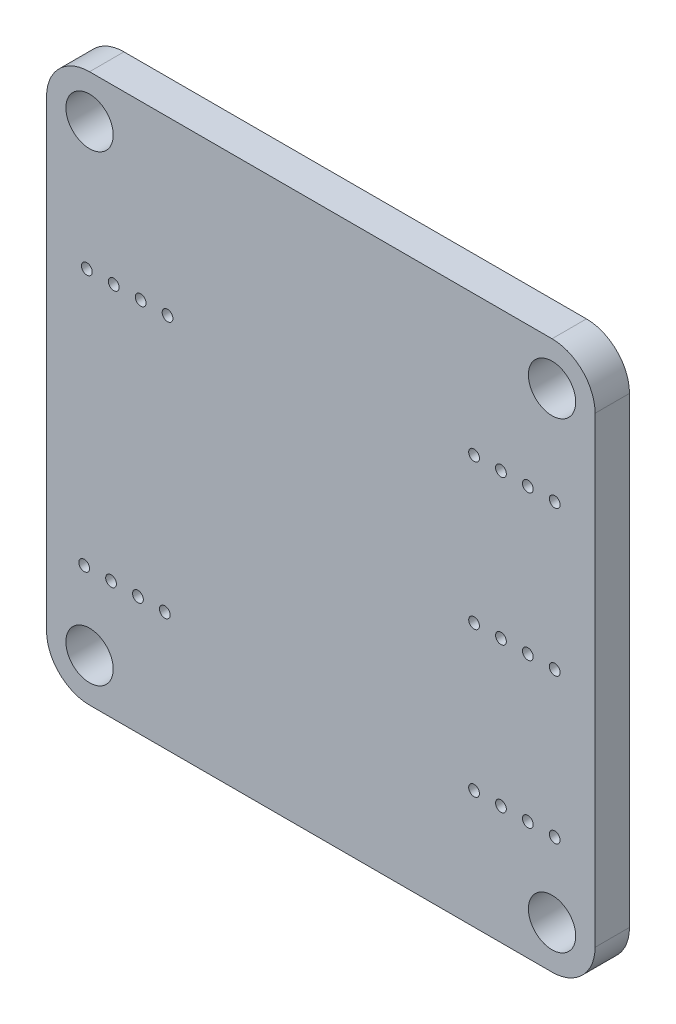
ISO-10303-21;
HEADER;
FILE_DESCRIPTION(('STEP AP214'),'2;1');
FILE_NAME('part.step','',(''),(''),'','','');
FILE_SCHEMA(('AUTOMOTIVE_DESIGN { 1 0 10303 214 1 1 1 1 }'));
ENDSEC;
DATA;
#1=APPLICATION_CONTEXT('core data for automotive mechanical design processes');
#2=APPLICATION_PROTOCOL_DEFINITION('international standard','automotive_design',2000,#1);
#3=PRODUCT_CONTEXT('',#1,'mechanical');
#4=PRODUCT('Part','Part','',(#3));
#5=PRODUCT_RELATED_PRODUCT_CATEGORY('part','',(#4));
#6=PRODUCT_DEFINITION_FORMATION('','',#4);
#7=PRODUCT_DEFINITION_CONTEXT('part definition',#1,'design');
#8=PRODUCT_DEFINITION('design','',#6,#7);
#9=PRODUCT_DEFINITION_SHAPE('','',#8);
#10=(LENGTH_UNIT() NAMED_UNIT(*) SI_UNIT(.MILLI.,.METRE.));
#11=(NAMED_UNIT(*) PLANE_ANGLE_UNIT() SI_UNIT($,.RADIAN.));
#12=(NAMED_UNIT(*) SI_UNIT($,.STERADIAN.) SOLID_ANGLE_UNIT());
#13=UNCERTAINTY_MEASURE_WITH_UNIT(LENGTH_MEASURE(1.E-05),#10,'distance_accuracy_value','');
#14=(GEOMETRIC_REPRESENTATION_CONTEXT(3) GLOBAL_UNCERTAINTY_ASSIGNED_CONTEXT((#13)) GLOBAL_UNIT_ASSIGNED_CONTEXT((#10,
#11,#12)) REPRESENTATION_CONTEXT('',''));
#15=CARTESIAN_POINT('',(0.,0.,0.));
#16=DIRECTION('',(0.,0.,1.));
#17=DIRECTION('',(1.,0.,0.));
#18=AXIS2_PLACEMENT_3D('',#15,#16,#17);
#19=CARTESIAN_POINT('',(214.,-97.5,-0.8));
#20=DIRECTION('',(0.,0.,1.));
#21=DIRECTION('',(1.,0.,0.));
#22=AXIS2_PLACEMENT_3D('',#19,#20,#21);
#23=CYLINDRICAL_SURFACE('',#22,1.1);
#24=CARTESIAN_POINT('',(214.,-97.5,0.));
#25=DIRECTION('',(0.,0.,1.));
#26=DIRECTION('',(1.,0.,0.));
#27=AXIS2_PLACEMENT_3D('',#24,#25,#26);
#28=CIRCLE('',#27,1.1);
#29=CARTESIAN_POINT('',(212.9,-97.5,0.));
#30=VERTEX_POINT('',#29);
#31=EDGE_CURVE('E471',#30,#30,#28,.T.);
#32=ORIENTED_EDGE('',*,*,#31,.F.);
#33=DIRECTION('',(0.,0.,1.));
#34=VECTOR('',#33,1.);
#35=CARTESIAN_POINT('',(212.9,-97.5,-0.8));
#36=LINE('',#35,#34);
#37=CARTESIAN_POINT('',(212.9,-97.5,1.6));
#38=VERTEX_POINT('',#37);
#39=EDGE_CURVE('E10',#30,#38,#36,.T.);
#40=ORIENTED_EDGE('',*,*,#39,.T.);
#41=CARTESIAN_POINT('',(214.,-97.5,1.6));
#42=DIRECTION('',(0.,0.,1.));
#43=DIRECTION('',(1.,0.,0.));
#44=AXIS2_PLACEMENT_3D('',#41,#42,#43);
#45=CIRCLE('',#44,1.1);
#46=EDGE_CURVE('E501',#38,#38,#45,.T.);
#47=ORIENTED_EDGE('',*,*,#46,.T.);
#48=ORIENTED_EDGE('',*,*,#39,.F.);
#49=EDGE_LOOP('',(#32,#40,#47,#48));
#50=FACE_BOUND('',#49,.T.);
#51=ADVANCED_FACE('F16',(#50),#23,.F.);
#52=CARTESIAN_POINT('',(214.125,-102.,-0.8));
#53=DIRECTION('',(0.,0.,1.));
#54=DIRECTION('',(1.,0.,0.));
#55=AXIS2_PLACEMENT_3D('',#52,#53,#54);
#56=CYLINDRICAL_SURFACE('',#55,0.25);
#57=CARTESIAN_POINT('',(214.125,-102.,0.));
#58=DIRECTION('',(0.,0.,1.));
#59=DIRECTION('',(1.,0.,0.));
#60=AXIS2_PLACEMENT_3D('',#57,#58,#59);
#61=CIRCLE('',#60,0.25);
#62=CARTESIAN_POINT('',(213.875,-102.,0.));
#63=VERTEX_POINT('',#62);
#64=EDGE_CURVE('E467',#63,#63,#61,.T.);
#65=ORIENTED_EDGE('',*,*,#64,.F.);
#66=DIRECTION('',(0.,0.,1.));
#67=VECTOR('',#66,1.);
#68=CARTESIAN_POINT('',(213.875,-102.,-0.8));
#69=LINE('',#68,#67);
#70=CARTESIAN_POINT('',(213.875,-102.,1.6));
#71=VERTEX_POINT('',#70);
#72=EDGE_CURVE('E20',#63,#71,#69,.T.);
#73=ORIENTED_EDGE('',*,*,#72,.T.);
#74=CARTESIAN_POINT('',(214.125,-102.,1.6));
#75=DIRECTION('',(0.,0.,1.));
#76=DIRECTION('',(1.,0.,0.));
#77=AXIS2_PLACEMENT_3D('',#74,#75,#76);
#78=CIRCLE('',#77,0.25);
#79=EDGE_CURVE('E466',#71,#71,#78,.T.);
#80=ORIENTED_EDGE('',*,*,#79,.T.);
#81=ORIENTED_EDGE('',*,*,#72,.F.);
#82=EDGE_LOOP('',(#65,#73,#80,#81));
#83=FACE_BOUND('',#82,.T.);
#84=ADVANCED_FACE('F18',(#83),#56,.F.);
#85=CARTESIAN_POINT('',(214.125,-108.75,-0.8));
#86=DIRECTION('',(0.,0.,1.));
#87=DIRECTION('',(1.,0.,0.));
#88=AXIS2_PLACEMENT_3D('',#85,#86,#87);
#89=CYLINDRICAL_SURFACE('',#88,0.25);
#90=CARTESIAN_POINT('',(214.125,-108.75,0.));
#91=DIRECTION('',(0.,0.,1.));
#92=DIRECTION('',(1.,0.,0.));
#93=AXIS2_PLACEMENT_3D('',#90,#91,#92);
#94=CIRCLE('',#93,0.25);
#95=CARTESIAN_POINT('',(213.875,-108.75,0.));
#96=VERTEX_POINT('',#95);
#97=EDGE_CURVE('E460',#96,#96,#94,.T.);
#98=ORIENTED_EDGE('',*,*,#97,.F.);
#99=DIRECTION('',(0.,0.,1.));
#100=VECTOR('',#99,1.);
#101=CARTESIAN_POINT('',(213.875,-108.75,-0.8));
#102=LINE('',#101,#100);
#103=CARTESIAN_POINT('',(213.875,-108.75,1.6));
#104=VERTEX_POINT('',#103);
#105=EDGE_CURVE('E583',#96,#104,#102,.T.);
#106=ORIENTED_EDGE('',*,*,#105,.T.);
#107=CARTESIAN_POINT('',(214.125,-108.75,1.6));
#108=DIRECTION('',(0.,0.,1.));
#109=DIRECTION('',(1.,0.,0.));
#110=AXIS2_PLACEMENT_3D('',#107,#108,#109);
#111=CIRCLE('',#110,0.25);
#112=EDGE_CURVE('E465',#104,#104,#111,.T.);
#113=ORIENTED_EDGE('',*,*,#112,.T.);
#114=ORIENTED_EDGE('',*,*,#105,.F.);
#115=EDGE_LOOP('',(#98,#106,#113,#114));
#116=FACE_BOUND('',#115,.T.);
#117=ADVANCED_FACE('F1039',(#116),#89,.F.);
#118=CARTESIAN_POINT('',(210.375,-108.75,-0.8));
#119=DIRECTION('',(0.,0.,1.));
#120=DIRECTION('',(1.,0.,0.));
#121=AXIS2_PLACEMENT_3D('',#118,#119,#120);
#122=CYLINDRICAL_SURFACE('',#121,0.25);
#123=CARTESIAN_POINT('',(210.375,-108.75,0.));
#124=DIRECTION('',(0.,0.,1.));
#125=DIRECTION('',(1.,0.,0.));
#126=AXIS2_PLACEMENT_3D('',#123,#124,#125);
#127=CIRCLE('',#126,0.25);
#128=CARTESIAN_POINT('',(210.125,-108.75,0.));
#129=VERTEX_POINT('',#128);
#130=EDGE_CURVE('E446',#129,#129,#127,.T.);
#131=ORIENTED_EDGE('',*,*,#130,.F.);
#132=DIRECTION('',(0.,0.,1.));
#133=VECTOR('',#132,1.);
#134=CARTESIAN_POINT('',(210.125,-108.75,-0.8));
#135=LINE('',#134,#133);
#136=CARTESIAN_POINT('',(210.125,-108.75,1.6));
#137=VERTEX_POINT('',#136);
#138=EDGE_CURVE('E581',#129,#137,#135,.T.);
#139=ORIENTED_EDGE('',*,*,#138,.T.);
#140=CARTESIAN_POINT('',(210.375,-108.75,1.6));
#141=DIRECTION('',(0.,0.,1.));
#142=DIRECTION('',(1.,0.,0.));
#143=AXIS2_PLACEMENT_3D('',#140,#141,#142);
#144=CIRCLE('',#143,0.25);
#145=EDGE_CURVE('E479',#137,#137,#144,.T.);
#146=ORIENTED_EDGE('',*,*,#145,.T.);
#147=ORIENTED_EDGE('',*,*,#138,.F.);
#148=EDGE_LOOP('',(#131,#139,#146,#147));
#149=FACE_BOUND('',#148,.T.);
#150=ADVANCED_FACE('F1046',(#149),#122,.F.);
#151=CARTESIAN_POINT('',(211.625,-108.75,-0.8));
#152=DIRECTION('',(0.,0.,1.));
#153=DIRECTION('',(1.,0.,0.));
#154=AXIS2_PLACEMENT_3D('',#151,#152,#153);
#155=CYLINDRICAL_SURFACE('',#154,0.25);
#156=CARTESIAN_POINT('',(211.625,-108.75,0.));
#157=DIRECTION('',(0.,0.,1.));
#158=DIRECTION('',(1.,0.,0.));
#159=AXIS2_PLACEMENT_3D('',#156,#157,#158);
#160=CIRCLE('',#159,0.25);
#161=CARTESIAN_POINT('',(211.375,-108.75,0.));
#162=VERTEX_POINT('',#161);
#163=EDGE_CURVE('E381',#162,#162,#160,.T.);
#164=ORIENTED_EDGE('',*,*,#163,.F.);
#165=DIRECTION('',(0.,0.,1.));
#166=VECTOR('',#165,1.);
#167=CARTESIAN_POINT('',(211.375,-108.75,-0.8));
#168=LINE('',#167,#166);
#169=CARTESIAN_POINT('',(211.375,-108.75,1.6));
#170=VERTEX_POINT('',#169);
#171=EDGE_CURVE('E346',#162,#170,#168,.T.);
#172=ORIENTED_EDGE('',*,*,#171,.T.);
#173=CARTESIAN_POINT('',(211.625,-108.75,1.6));
#174=DIRECTION('',(0.,0.,1.));
#175=DIRECTION('',(1.,0.,0.));
#176=AXIS2_PLACEMENT_3D('',#173,#174,#175);
#177=CIRCLE('',#176,0.25);
#178=EDGE_CURVE('E425',#170,#170,#177,.T.);
#179=ORIENTED_EDGE('',*,*,#178,.T.);
#180=ORIENTED_EDGE('',*,*,#171,.F.);
#181=EDGE_LOOP('',(#164,#172,#179,#180));
#182=FACE_BOUND('',#181,.T.);
#183=ADVANCED_FACE('F1042',(#182),#155,.F.);
#184=CARTESIAN_POINT('',(212.875,-108.75,-0.8));
#185=DIRECTION('',(0.,0.,1.));
#186=DIRECTION('',(1.,0.,0.));
#187=AXIS2_PLACEMENT_3D('',#184,#185,#186);
#188=CYLINDRICAL_SURFACE('',#187,0.25);
#189=CARTESIAN_POINT('',(212.875,-108.75,0.));
#190=DIRECTION('',(0.,0.,1.));
#191=DIRECTION('',(1.,0.,0.));
#192=AXIS2_PLACEMENT_3D('',#189,#190,#191);
#193=CIRCLE('',#192,0.25);
#194=CARTESIAN_POINT('',(212.625,-108.75,0.));
#195=VERTEX_POINT('',#194);
#196=EDGE_CURVE('E377',#195,#195,#193,.T.);
#197=ORIENTED_EDGE('',*,*,#196,.F.);
#198=DIRECTION('',(0.,0.,1.));
#199=VECTOR('',#198,1.);
#200=CARTESIAN_POINT('',(212.625,-108.75,-0.8));
#201=LINE('',#200,#199);
#202=CARTESIAN_POINT('',(212.625,-108.75,1.6));
#203=VERTEX_POINT('',#202);
#204=EDGE_CURVE('E343',#195,#203,#201,.T.);
#205=ORIENTED_EDGE('',*,*,#204,.T.);
#206=CARTESIAN_POINT('',(212.875,-108.75,1.6));
#207=DIRECTION('',(0.,0.,1.));
#208=DIRECTION('',(1.,0.,0.));
#209=AXIS2_PLACEMENT_3D('',#206,#207,#208);
#210=CIRCLE('',#209,0.25);
#211=EDGE_CURVE('E367',#203,#203,#210,.T.);
#212=ORIENTED_EDGE('',*,*,#211,.T.);
#213=ORIENTED_EDGE('',*,*,#204,.F.);
#214=EDGE_LOOP('',(#197,#205,#212,#213));
#215=FACE_BOUND('',#214,.T.);
#216=ADVANCED_FACE('F1045',(#215),#188,.F.);
#217=CARTESIAN_POINT('',(212.875,-102.,-0.8));
#218=DIRECTION('',(0.,0.,1.));
#219=DIRECTION('',(1.,0.,0.));
#220=AXIS2_PLACEMENT_3D('',#217,#218,#219);
#221=CYLINDRICAL_SURFACE('',#220,0.25);
#222=CARTESIAN_POINT('',(212.875,-102.,0.));
#223=DIRECTION('',(0.,0.,1.));
#224=DIRECTION('',(1.,0.,0.));
#225=AXIS2_PLACEMENT_3D('',#222,#223,#224);
#226=CIRCLE('',#225,0.25);
#227=CARTESIAN_POINT('',(212.625,-102.,0.));
#228=VERTEX_POINT('',#227);
#229=EDGE_CURVE('E382',#228,#228,#226,.T.);
#230=ORIENTED_EDGE('',*,*,#229,.F.);
#231=DIRECTION('',(0.,0.,1.));
#232=VECTOR('',#231,1.);
#233=CARTESIAN_POINT('',(212.625,-102.,-0.8));
#234=LINE('',#233,#232);
#235=CARTESIAN_POINT('',(212.625,-102.,1.6));
#236=VERTEX_POINT('',#235);
#237=EDGE_CURVE('E347',#228,#236,#234,.T.);
#238=ORIENTED_EDGE('',*,*,#237,.T.);
#239=CARTESIAN_POINT('',(212.875,-102.,1.6));
#240=DIRECTION('',(0.,0.,1.));
#241=DIRECTION('',(1.,0.,0.));
#242=AXIS2_PLACEMENT_3D('',#239,#240,#241);
#243=CIRCLE('',#242,0.25);
#244=EDGE_CURVE('E505',#236,#236,#243,.T.);
#245=ORIENTED_EDGE('',*,*,#244,.T.);
#246=ORIENTED_EDGE('',*,*,#237,.F.);
#247=EDGE_LOOP('',(#230,#238,#245,#246));
#248=FACE_BOUND('',#247,.T.);
#249=ADVANCED_FACE('F1092',(#248),#221,.F.);
#250=CARTESIAN_POINT('',(211.625,-102.,-0.8));
#251=DIRECTION('',(0.,0.,1.));
#252=DIRECTION('',(1.,0.,0.));
#253=AXIS2_PLACEMENT_3D('',#250,#251,#252);
#254=CYLINDRICAL_SURFACE('',#253,0.25);
#255=CARTESIAN_POINT('',(211.625,-102.,0.));
#256=DIRECTION('',(0.,0.,1.));
#257=DIRECTION('',(1.,0.,0.));
#258=AXIS2_PLACEMENT_3D('',#255,#256,#257);
#259=CIRCLE('',#258,0.25);
#260=CARTESIAN_POINT('',(211.375,-102.,0.));
#261=VERTEX_POINT('',#260);
#262=EDGE_CURVE('E432',#261,#261,#259,.T.);
#263=ORIENTED_EDGE('',*,*,#262,.F.);
#264=DIRECTION('',(0.,0.,1.));
#265=VECTOR('',#264,1.);
#266=CARTESIAN_POINT('',(211.375,-102.,-0.8));
#267=LINE('',#266,#265);
#268=CARTESIAN_POINT('',(211.375,-102.,1.6));
#269=VERTEX_POINT('',#268);
#270=EDGE_CURVE('E513',#261,#269,#267,.T.);
#271=ORIENTED_EDGE('',*,*,#270,.T.);
#272=CARTESIAN_POINT('',(211.625,-102.,1.6));
#273=DIRECTION('',(0.,0.,1.));
#274=DIRECTION('',(1.,0.,0.));
#275=AXIS2_PLACEMENT_3D('',#272,#273,#274);
#276=CIRCLE('',#275,0.25);
#277=EDGE_CURVE('E452',#269,#269,#276,.T.);
#278=ORIENTED_EDGE('',*,*,#277,.T.);
#279=ORIENTED_EDGE('',*,*,#270,.F.);
#280=EDGE_LOOP('',(#263,#271,#278,#279));
#281=FACE_BOUND('',#280,.T.);
#282=ADVANCED_FACE('F1086',(#281),#254,.F.);
#283=CARTESIAN_POINT('',(210.375,-102.,-0.8));
#284=DIRECTION('',(0.,0.,1.));
#285=DIRECTION('',(1.,0.,0.));
#286=AXIS2_PLACEMENT_3D('',#283,#284,#285);
#287=CYLINDRICAL_SURFACE('',#286,0.25);
#288=CARTESIAN_POINT('',(210.375,-102.,0.));
#289=DIRECTION('',(0.,0.,1.));
#290=DIRECTION('',(1.,0.,0.));
#291=AXIS2_PLACEMENT_3D('',#288,#289,#290);
#292=CIRCLE('',#291,0.25);
#293=CARTESIAN_POINT('',(210.125,-102.,0.));
#294=VERTEX_POINT('',#293);
#295=EDGE_CURVE('E421',#294,#294,#292,.T.);
#296=ORIENTED_EDGE('',*,*,#295,.F.);
#297=DIRECTION('',(0.,0.,1.));
#298=VECTOR('',#297,1.);
#299=CARTESIAN_POINT('',(210.125,-102.,-0.8));
#300=LINE('',#299,#298);
#301=CARTESIAN_POINT('',(210.125,-102.,1.6));
#302=VERTEX_POINT('',#301);
#303=EDGE_CURVE('E417',#294,#302,#300,.T.);
#304=ORIENTED_EDGE('',*,*,#303,.T.);
#305=CARTESIAN_POINT('',(210.375,-102.,1.6));
#306=DIRECTION('',(0.,0.,1.));
#307=DIRECTION('',(1.,0.,0.));
#308=AXIS2_PLACEMENT_3D('',#305,#306,#307);
#309=CIRCLE('',#308,0.25);
#310=EDGE_CURVE('E492',#302,#302,#309,.T.);
#311=ORIENTED_EDGE('',*,*,#310,.T.);
#312=ORIENTED_EDGE('',*,*,#303,.F.);
#313=EDGE_LOOP('',(#296,#304,#311,#312));
#314=FACE_BOUND('',#313,.T.);
#315=ADVANCED_FACE('F1083',(#314),#287,.F.);
#316=CARTESIAN_POINT('',(211.625,-115.5,-0.8));
#317=DIRECTION('',(0.,0.,1.));
#318=DIRECTION('',(1.,0.,0.));
#319=AXIS2_PLACEMENT_3D('',#316,#317,#318);
#320=CYLINDRICAL_SURFACE('',#319,0.25);
#321=CARTESIAN_POINT('',(211.625,-115.5,0.));
#322=DIRECTION('',(0.,0.,1.));
#323=DIRECTION('',(1.,0.,0.));
#324=AXIS2_PLACEMENT_3D('',#321,#322,#323);
#325=CIRCLE('',#324,0.25);
#326=CARTESIAN_POINT('',(211.375,-115.5,0.));
#327=VERTEX_POINT('',#326);
#328=EDGE_CURVE('E406',#327,#327,#325,.T.);
#329=ORIENTED_EDGE('',*,*,#328,.F.);
#330=DIRECTION('',(0.,0.,1.));
#331=VECTOR('',#330,1.);
#332=CARTESIAN_POINT('',(211.375,-115.5,-0.8));
#333=LINE('',#332,#331);
#334=CARTESIAN_POINT('',(211.375,-115.5,1.6));
#335=VERTEX_POINT('',#334);
#336=EDGE_CURVE('E375',#327,#335,#333,.T.);
#337=ORIENTED_EDGE('',*,*,#336,.T.);
#338=CARTESIAN_POINT('',(211.625,-115.5,1.6));
#339=DIRECTION('',(0.,0.,1.));
#340=DIRECTION('',(1.,0.,0.));
#341=AXIS2_PLACEMENT_3D('',#338,#339,#340);
#342=CIRCLE('',#341,0.25);
#343=EDGE_CURVE('E447',#335,#335,#342,.T.);
#344=ORIENTED_EDGE('',*,*,#343,.T.);
#345=ORIENTED_EDGE('',*,*,#336,.F.);
#346=EDGE_LOOP('',(#329,#337,#344,#345));
#347=FACE_BOUND('',#346,.T.);
#348=ADVANCED_FACE('F1080',(#347),#320,.F.);
#349=CARTESIAN_POINT('',(210.375,-115.5,-0.8));
#350=DIRECTION('',(0.,0.,1.));
#351=DIRECTION('',(1.,0.,0.));
#352=AXIS2_PLACEMENT_3D('',#349,#350,#351);
#353=CYLINDRICAL_SURFACE('',#352,0.25);
#354=CARTESIAN_POINT('',(210.375,-115.5,0.));
#355=DIRECTION('',(0.,0.,1.));
#356=DIRECTION('',(1.,0.,0.));
#357=AXIS2_PLACEMENT_3D('',#354,#355,#356);
#358=CIRCLE('',#357,0.25);
#359=CARTESIAN_POINT('',(210.125,-115.5,0.));
#360=VERTEX_POINT('',#359);
#361=EDGE_CURVE('E402',#360,#360,#358,.T.);
#362=ORIENTED_EDGE('',*,*,#361,.F.);
#363=DIRECTION('',(0.,0.,1.));
#364=VECTOR('',#363,1.);
#365=CARTESIAN_POINT('',(210.125,-115.5,-0.8));
#366=LINE('',#365,#364);
#367=CARTESIAN_POINT('',(210.125,-115.5,1.6));
#368=VERTEX_POINT('',#367);
#369=EDGE_CURVE('E372',#360,#368,#366,.T.);
#370=ORIENTED_EDGE('',*,*,#369,.T.);
#371=CARTESIAN_POINT('',(210.375,-115.5,1.6));
#372=DIRECTION('',(0.,0.,1.));
#373=DIRECTION('',(1.,0.,0.));
#374=AXIS2_PLACEMENT_3D('',#371,#372,#373);
#375=CIRCLE('',#374,0.25);
#376=EDGE_CURVE('E366',#368,#368,#375,.T.);
#377=ORIENTED_EDGE('',*,*,#376,.T.);
#378=ORIENTED_EDGE('',*,*,#369,.F.);
#379=EDGE_LOOP('',(#362,#370,#377,#378));
#380=FACE_BOUND('',#379,.T.);
#381=ADVANCED_FACE('F1068',(#380),#353,.F.);
#382=CARTESIAN_POINT('',(212.875,-115.5,-0.8));
#383=DIRECTION('',(0.,0.,1.));
#384=DIRECTION('',(1.,0.,0.));
#385=AXIS2_PLACEMENT_3D('',#382,#383,#384);
#386=CYLINDRICAL_SURFACE('',#385,0.25);
#387=CARTESIAN_POINT('',(212.875,-115.5,0.));
#388=DIRECTION('',(0.,0.,1.));
#389=DIRECTION('',(1.,0.,0.));
#390=AXIS2_PLACEMENT_3D('',#387,#388,#389);
#391=CIRCLE('',#390,0.25);
#392=CARTESIAN_POINT('',(212.625,-115.5,0.));
#393=VERTEX_POINT('',#392);
#394=EDGE_CURVE('E407',#393,#393,#391,.T.);
#395=ORIENTED_EDGE('',*,*,#394,.F.);
#396=DIRECTION('',(0.,0.,1.));
#397=VECTOR('',#396,1.);
#398=CARTESIAN_POINT('',(212.625,-115.5,-0.8));
#399=LINE('',#398,#397);
#400=CARTESIAN_POINT('',(212.625,-115.5,1.6));
#401=VERTEX_POINT('',#400);
#402=EDGE_CURVE('E376',#393,#401,#399,.T.);
#403=ORIENTED_EDGE('',*,*,#402,.T.);
#404=CARTESIAN_POINT('',(212.875,-115.5,1.6));
#405=DIRECTION('',(0.,0.,1.));
#406=DIRECTION('',(1.,0.,0.));
#407=AXIS2_PLACEMENT_3D('',#404,#405,#406);
#408=CIRCLE('',#407,0.25);
#409=EDGE_CURVE('E362',#401,#401,#408,.T.);
#410=ORIENTED_EDGE('',*,*,#409,.T.);
#411=ORIENTED_EDGE('',*,*,#402,.F.);
#412=EDGE_LOOP('',(#395,#403,#410,#411));
#413=FACE_BOUND('',#412,.T.);
#414=ADVANCED_FACE('F1065',(#413),#386,.F.);
#415=CARTESIAN_POINT('',(214.125,-115.5,-0.8));
#416=DIRECTION('',(0.,0.,1.));
#417=DIRECTION('',(1.,0.,0.));
#418=AXIS2_PLACEMENT_3D('',#415,#416,#417);
#419=CYLINDRICAL_SURFACE('',#418,0.25);
#420=CARTESIAN_POINT('',(214.125,-115.5,0.));
#421=DIRECTION('',(0.,0.,1.));
#422=DIRECTION('',(1.,0.,0.));
#423=AXIS2_PLACEMENT_3D('',#420,#421,#422);
#424=CIRCLE('',#423,0.25);
#425=CARTESIAN_POINT('',(213.875,-115.5,0.));
#426=VERTEX_POINT('',#425);
#427=EDGE_CURVE('E411',#426,#426,#424,.T.);
#428=ORIENTED_EDGE('',*,*,#427,.F.);
#429=DIRECTION('',(0.,0.,1.));
#430=VECTOR('',#429,1.);
#431=CARTESIAN_POINT('',(213.875,-115.5,-0.8));
#432=LINE('',#431,#430);
#433=CARTESIAN_POINT('',(213.875,-115.5,1.6));
#434=VERTEX_POINT('',#433);
#435=EDGE_CURVE('E480',#426,#434,#432,.T.);
#436=ORIENTED_EDGE('',*,*,#435,.T.);
#437=CARTESIAN_POINT('',(214.125,-115.5,1.6));
#438=DIRECTION('',(0.,0.,1.));
#439=DIRECTION('',(1.,0.,0.));
#440=AXIS2_PLACEMENT_3D('',#437,#438,#439);
#441=CIRCLE('',#440,0.25);
#442=EDGE_CURVE('E461',#434,#434,#441,.T.);
#443=ORIENTED_EDGE('',*,*,#442,.T.);
#444=ORIENTED_EDGE('',*,*,#435,.F.);
#445=EDGE_LOOP('',(#428,#436,#443,#444));
#446=FACE_BOUND('',#445,.T.);
#447=ADVANCED_FACE('F1067',(#446),#419,.F.);
#448=CARTESIAN_POINT('',(214.,-119.,-0.8));
#449=DIRECTION('',(0.,0.,1.));
#450=DIRECTION('',(1.,0.,0.));
#451=AXIS2_PLACEMENT_3D('',#448,#449,#450);
#452=CYLINDRICAL_SURFACE('',#451,1.1);
#453=CARTESIAN_POINT('',(214.,-119.,0.));
#454=DIRECTION('',(0.,0.,1.));
#455=DIRECTION('',(1.,0.,0.));
#456=AXIS2_PLACEMENT_3D('',#453,#454,#455);
#457=CIRCLE('',#456,1.1);
#458=CARTESIAN_POINT('',(212.9,-119.,0.));
#459=VERTEX_POINT('',#458);
#460=EDGE_CURVE('E401',#459,#459,#457,.T.);
#461=ORIENTED_EDGE('',*,*,#460,.F.);
#462=DIRECTION('',(0.,0.,1.));
#463=VECTOR('',#462,1.);
#464=CARTESIAN_POINT('',(212.9,-119.,-0.8));
#465=LINE('',#464,#463);
#466=CARTESIAN_POINT('',(212.9,-119.,1.6));
#467=VERTEX_POINT('',#466);
#468=EDGE_CURVE('E38',#459,#467,#465,.T.);
#469=ORIENTED_EDGE('',*,*,#468,.T.);
#470=CARTESIAN_POINT('',(214.,-119.,1.6));
#471=DIRECTION('',(0.,0.,1.));
#472=DIRECTION('',(1.,0.,0.));
#473=AXIS2_PLACEMENT_3D('',#470,#471,#472);
#474=CIRCLE('',#473,1.1);
#475=EDGE_CURVE('E558',#467,#467,#474,.T.);
#476=ORIENTED_EDGE('',*,*,#475,.T.);
#477=ORIENTED_EDGE('',*,*,#468,.F.);
#478=EDGE_LOOP('',(#461,#469,#476,#477));
#479=FACE_BOUND('',#478,.T.);
#480=ADVANCED_FACE('F1137',(#479),#452,.F.);
#481=CARTESIAN_POINT('',(196.125,-103.5,-0.8));
#482=DIRECTION('',(0.,0.,1.));
#483=DIRECTION('',(1.,0.,0.));
#484=AXIS2_PLACEMENT_3D('',#481,#482,#483);
#485=CYLINDRICAL_SURFACE('',#484,0.25);
#486=CARTESIAN_POINT('',(196.125,-103.5,0.));
#487=DIRECTION('',(0.,0.,1.));
#488=DIRECTION('',(1.,0.,0.));
#489=AXIS2_PLACEMENT_3D('',#486,#487,#488);
#490=CIRCLE('',#489,0.25);
#491=CARTESIAN_POINT('',(195.875,-103.5,0.));
#492=VERTEX_POINT('',#491);
#493=EDGE_CURVE('E391',#492,#492,#490,.T.);
#494=ORIENTED_EDGE('',*,*,#493,.F.);
#495=DIRECTION('',(0.,0.,1.));
#496=VECTOR('',#495,1.);
#497=CARTESIAN_POINT('',(195.875,-103.5,-0.8));
#498=LINE('',#497,#496);
#499=CARTESIAN_POINT('',(195.875,-103.5,1.6));
#500=VERTEX_POINT('',#499);
#501=EDGE_CURVE('E436',#492,#500,#498,.T.);
#502=ORIENTED_EDGE('',*,*,#501,.T.);
#503=CARTESIAN_POINT('',(196.125,-103.5,1.6));
#504=DIRECTION('',(0.,0.,1.));
#505=DIRECTION('',(1.,0.,0.));
#506=AXIS2_PLACEMENT_3D('',#503,#504,#505);
#507=CIRCLE('',#506,0.25);
#508=EDGE_CURVE('E524',#500,#500,#507,.T.);
#509=ORIENTED_EDGE('',*,*,#508,.T.);
#510=ORIENTED_EDGE('',*,*,#501,.F.);
#511=EDGE_LOOP('',(#494,#502,#509,#510));
#512=FACE_BOUND('',#511,.T.);
#513=ADVANCED_FACE('F1133',(#512),#485,.F.);
#514=CARTESIAN_POINT('',(196.,-115.5,-0.8));
#515=DIRECTION('',(0.,0.,1.));
#516=DIRECTION('',(1.,0.,0.));
#517=AXIS2_PLACEMENT_3D('',#514,#515,#516);
#518=CYLINDRICAL_SURFACE('',#517,0.25);
#519=CARTESIAN_POINT('',(196.,-115.5,0.));
#520=DIRECTION('',(0.,0.,1.));
#521=DIRECTION('',(1.,0.,0.));
#522=AXIS2_PLACEMENT_3D('',#519,#520,#521);
#523=CIRCLE('',#522,0.25);
#524=CARTESIAN_POINT('',(195.75,-115.5,0.));
#525=VERTEX_POINT('',#524);
#526=EDGE_CURVE('E387',#525,#525,#523,.T.);
#527=ORIENTED_EDGE('',*,*,#526,.F.);
#528=DIRECTION('',(0.,0.,1.));
#529=VECTOR('',#528,1.);
#530=CARTESIAN_POINT('',(195.75,-115.5,-0.8));
#531=LINE('',#530,#529);
#532=CARTESIAN_POINT('',(195.75,-115.5,1.6));
#533=VERTEX_POINT('',#532);
#534=EDGE_CURVE('E439',#525,#533,#531,.T.);
#535=ORIENTED_EDGE('',*,*,#534,.T.);
#536=CARTESIAN_POINT('',(196.,-115.5,1.6));
#537=DIRECTION('',(0.,0.,1.));
#538=DIRECTION('',(1.,0.,0.));
#539=AXIS2_PLACEMENT_3D('',#536,#537,#538);
#540=CIRCLE('',#539,0.25);
#541=EDGE_CURVE('E500',#533,#533,#540,.T.);
#542=ORIENTED_EDGE('',*,*,#541,.T.);
#543=ORIENTED_EDGE('',*,*,#534,.F.);
#544=EDGE_LOOP('',(#527,#535,#542,#543));
#545=FACE_BOUND('',#544,.T.);
#546=ADVANCED_FACE('F1130',(#545),#518,.F.);
#547=CARTESIAN_POINT('',(194.75,-115.5,-0.8));
#548=DIRECTION('',(0.,0.,1.));
#549=DIRECTION('',(1.,0.,0.));
#550=AXIS2_PLACEMENT_3D('',#547,#548,#549);
#551=CYLINDRICAL_SURFACE('',#550,0.25);
#552=CARTESIAN_POINT('',(194.75,-115.5,0.));
#553=DIRECTION('',(0.,0.,1.));
#554=DIRECTION('',(1.,0.,0.));
#555=AXIS2_PLACEMENT_3D('',#552,#553,#554);
#556=CIRCLE('',#555,0.25);
#557=CARTESIAN_POINT('',(194.5,-115.5,0.));
#558=VERTEX_POINT('',#557);
#559=EDGE_CURVE('E392',#558,#558,#556,.T.);
#560=ORIENTED_EDGE('',*,*,#559,.F.);
#561=DIRECTION('',(0.,0.,1.));
#562=VECTOR('',#561,1.);
#563=CARTESIAN_POINT('',(194.5,-115.5,-0.8));
#564=LINE('',#563,#562);
#565=CARTESIAN_POINT('',(194.5,-115.5,1.6));
#566=VERTEX_POINT('',#565);
#567=EDGE_CURVE('E535',#558,#566,#564,.T.);
#568=ORIENTED_EDGE('',*,*,#567,.T.);
#569=CARTESIAN_POINT('',(194.75,-115.5,1.6));
#570=DIRECTION('',(0.,0.,1.));
#571=DIRECTION('',(1.,0.,0.));
#572=AXIS2_PLACEMENT_3D('',#569,#570,#571);
#573=CIRCLE('',#572,0.25);
#574=EDGE_CURVE('E510',#566,#566,#573,.T.);
#575=ORIENTED_EDGE('',*,*,#574,.T.);
#576=ORIENTED_EDGE('',*,*,#567,.F.);
#577=EDGE_LOOP('',(#560,#568,#575,#576));
#578=FACE_BOUND('',#577,.T.);
#579=ADVANCED_FACE('F1128',(#578),#551,.F.);
#580=CARTESIAN_POINT('',(193.5,-115.5,-0.8));
#581=DIRECTION('',(0.,0.,1.));
#582=DIRECTION('',(1.,0.,0.));
#583=AXIS2_PLACEMENT_3D('',#580,#581,#582);
#584=CYLINDRICAL_SURFACE('',#583,0.25);
#585=CARTESIAN_POINT('',(193.5,-115.5,0.));
#586=DIRECTION('',(0.,0.,1.));
#587=DIRECTION('',(1.,0.,0.));
#588=AXIS2_PLACEMENT_3D('',#585,#586,#587);
#589=CIRCLE('',#588,0.25);
#590=CARTESIAN_POINT('',(193.25,-115.5,0.));
#591=VERTEX_POINT('',#590);
#592=EDGE_CURVE('E386',#591,#591,#589,.T.);
#593=ORIENTED_EDGE('',*,*,#592,.F.);
#594=DIRECTION('',(0.,0.,1.));
#595=VECTOR('',#594,1.);
#596=CARTESIAN_POINT('',(193.25,-115.5,-0.8));
#597=LINE('',#596,#595);
#598=CARTESIAN_POINT('',(193.25,-115.5,1.6));
#599=VERTEX_POINT('',#598);
#600=EDGE_CURVE('E532',#591,#599,#597,.T.);
#601=ORIENTED_EDGE('',*,*,#600,.T.);
#602=CARTESIAN_POINT('',(193.5,-115.5,1.6));
#603=DIRECTION('',(0.,0.,1.));
#604=DIRECTION('',(1.,0.,0.));
#605=AXIS2_PLACEMENT_3D('',#602,#603,#604);
#606=CIRCLE('',#605,0.25);
#607=EDGE_CURVE('E496',#599,#599,#606,.T.);
#608=ORIENTED_EDGE('',*,*,#607,.T.);
#609=ORIENTED_EDGE('',*,*,#600,.F.);
#610=EDGE_LOOP('',(#593,#601,#608,#609));
#611=FACE_BOUND('',#610,.T.);
#612=ADVANCED_FACE('F1052',(#611),#584,.F.);
#613=CARTESIAN_POINT('',(192.25,-115.5,-0.8));
#614=DIRECTION('',(0.,0.,1.));
#615=DIRECTION('',(1.,0.,0.));
#616=AXIS2_PLACEMENT_3D('',#613,#614,#615);
#617=CYLINDRICAL_SURFACE('',#616,0.25);
#618=CARTESIAN_POINT('',(192.25,-115.5,0.));
#619=DIRECTION('',(0.,0.,1.));
#620=DIRECTION('',(1.,0.,0.));
#621=AXIS2_PLACEMENT_3D('',#618,#619,#620);
#622=CIRCLE('',#621,0.25);
#623=CARTESIAN_POINT('',(192.,-115.5,0.));
#624=VERTEX_POINT('',#623);
#625=EDGE_CURVE('E371',#624,#624,#622,.T.);
#626=ORIENTED_EDGE('',*,*,#625,.F.);
#627=DIRECTION('',(0.,0.,1.));
#628=VECTOR('',#627,1.);
#629=CARTESIAN_POINT('',(192.,-115.5,-0.8));
#630=LINE('',#629,#628);
#631=CARTESIAN_POINT('',(192.,-115.5,1.6));
#632=VERTEX_POINT('',#631);
#633=EDGE_CURVE('E536',#624,#632,#630,.T.);
#634=ORIENTED_EDGE('',*,*,#633,.T.);
#635=CARTESIAN_POINT('',(192.25,-115.5,1.6));
#636=DIRECTION('',(0.,0.,1.));
#637=DIRECTION('',(1.,0.,0.));
#638=AXIS2_PLACEMENT_3D('',#635,#636,#637);
#639=CIRCLE('',#638,0.25);
#640=EDGE_CURVE('E456',#632,#632,#639,.T.);
#641=ORIENTED_EDGE('',*,*,#640,.T.);
#642=ORIENTED_EDGE('',*,*,#633,.F.);
#643=EDGE_LOOP('',(#626,#634,#641,#642));
#644=FACE_BOUND('',#643,.T.);
#645=ADVANCED_FACE('F1048',(#644),#617,.F.);
#646=CARTESIAN_POINT('',(192.5,-119.,-0.8));
#647=DIRECTION('',(0.,0.,1.));
#648=DIRECTION('',(1.,0.,0.));
#649=AXIS2_PLACEMENT_3D('',#646,#647,#648);
#650=CYLINDRICAL_SURFACE('',#649,1.1);
#651=CARTESIAN_POINT('',(192.5,-119.,0.));
#652=DIRECTION('',(0.,0.,1.));
#653=DIRECTION('',(1.,0.,0.));
#654=AXIS2_PLACEMENT_3D('',#651,#652,#653);
#655=CIRCLE('',#654,1.1);
#656=CARTESIAN_POINT('',(191.4,-119.,0.));
#657=VERTEX_POINT('',#656);
#658=EDGE_CURVE('E361',#657,#657,#655,.T.);
#659=ORIENTED_EDGE('',*,*,#658,.F.);
#660=DIRECTION('',(0.,0.,1.));
#661=VECTOR('',#660,1.);
#662=CARTESIAN_POINT('',(191.4,-119.,-0.8));
#663=LINE('',#662,#661);
#664=CARTESIAN_POINT('',(191.4,-119.,1.6));
#665=VERTEX_POINT('',#664);
#666=EDGE_CURVE('E47',#657,#665,#663,.T.);
#667=ORIENTED_EDGE('',*,*,#666,.T.);
#668=CARTESIAN_POINT('',(192.5,-119.,1.6));
#669=DIRECTION('',(0.,0.,1.));
#670=DIRECTION('',(1.,0.,0.));
#671=AXIS2_PLACEMENT_3D('',#668,#669,#670);
#672=CIRCLE('',#671,1.1);
#673=EDGE_CURVE('E451',#665,#665,#672,.T.);
#674=ORIENTED_EDGE('',*,*,#673,.T.);
#675=ORIENTED_EDGE('',*,*,#666,.F.);
#676=EDGE_LOOP('',(#659,#667,#674,#675));
#677=FACE_BOUND('',#676,.T.);
#678=ADVANCED_FACE('F1051',(#677),#650,.F.);
#679=CARTESIAN_POINT('',(192.375,-103.5,-0.8));
#680=DIRECTION('',(0.,0.,1.));
#681=DIRECTION('',(1.,0.,0.));
#682=AXIS2_PLACEMENT_3D('',#679,#680,#681);
#683=CYLINDRICAL_SURFACE('',#682,0.25);
#684=CARTESIAN_POINT('',(192.375,-103.5,0.));
#685=DIRECTION('',(0.,0.,1.));
#686=DIRECTION('',(1.,0.,0.));
#687=AXIS2_PLACEMENT_3D('',#684,#685,#686);
#688=CIRCLE('',#687,0.25);
#689=CARTESIAN_POINT('',(192.125,-103.5,0.));
#690=VERTEX_POINT('',#689);
#691=EDGE_CURVE('E351',#690,#690,#688,.T.);
#692=ORIENTED_EDGE('',*,*,#691,.F.);
#693=DIRECTION('',(0.,0.,1.));
#694=VECTOR('',#693,1.);
#695=CARTESIAN_POINT('',(192.125,-103.5,-0.8));
#696=LINE('',#695,#694);
#697=CARTESIAN_POINT('',(192.125,-103.5,1.6));
#698=VERTEX_POINT('',#697);
#699=EDGE_CURVE('E546',#690,#698,#696,.T.);
#700=ORIENTED_EDGE('',*,*,#699,.T.);
#701=CARTESIAN_POINT('',(192.375,-103.5,1.6));
#702=DIRECTION('',(0.,0.,1.));
#703=DIRECTION('',(1.,0.,0.));
#704=AXIS2_PLACEMENT_3D('',#701,#702,#703);
#705=CIRCLE('',#704,0.25);
#706=EDGE_CURVE('E519',#698,#698,#705,.T.);
#707=ORIENTED_EDGE('',*,*,#706,.T.);
#708=ORIENTED_EDGE('',*,*,#699,.F.);
#709=EDGE_LOOP('',(#692,#700,#707,#708));
#710=FACE_BOUND('',#709,.T.);
#711=ADVANCED_FACE('F1057',(#710),#683,.F.);
#712=CARTESIAN_POINT('',(193.625,-103.5,-0.8));
#713=DIRECTION('',(0.,0.,1.));
#714=DIRECTION('',(1.,0.,0.));
#715=AXIS2_PLACEMENT_3D('',#712,#713,#714);
#716=CYLINDRICAL_SURFACE('',#715,0.25);
#717=CARTESIAN_POINT('',(193.625,-103.5,0.));
#718=DIRECTION('',(0.,0.,1.));
#719=DIRECTION('',(1.,0.,0.));
#720=AXIS2_PLACEMENT_3D('',#717,#718,#719);
#721=CIRCLE('',#720,0.25);
#722=CARTESIAN_POINT('',(193.375,-103.5,0.));
#723=VERTEX_POINT('',#722);
#724=EDGE_CURVE('E342',#723,#723,#721,.T.);
#725=ORIENTED_EDGE('',*,*,#724,.F.);
#726=DIRECTION('',(0.,0.,1.));
#727=VECTOR('',#726,1.);
#728=CARTESIAN_POINT('',(193.375,-103.5,-0.8));
#729=LINE('',#728,#727);
#730=CARTESIAN_POINT('',(193.375,-103.5,1.6));
#731=VERTEX_POINT('',#730);
#732=EDGE_CURVE('E549',#723,#731,#729,.T.);
#733=ORIENTED_EDGE('',*,*,#732,.T.);
#734=CARTESIAN_POINT('',(193.625,-103.5,1.6));
#735=DIRECTION('',(0.,0.,1.));
#736=DIRECTION('',(1.,0.,0.));
#737=AXIS2_PLACEMENT_3D('',#734,#735,#736);
#738=CIRCLE('',#737,0.25);
#739=EDGE_CURVE('E523',#731,#731,#738,.T.);
#740=ORIENTED_EDGE('',*,*,#739,.T.);
#741=ORIENTED_EDGE('',*,*,#732,.F.);
#742=EDGE_LOOP('',(#725,#733,#740,#741));
#743=FACE_BOUND('',#742,.T.);
#744=ADVANCED_FACE('F1054',(#743),#716,.F.);
#745=CARTESIAN_POINT('',(194.875,-103.5,-0.8));
#746=DIRECTION('',(0.,0.,1.));
#747=DIRECTION('',(1.,0.,0.));
#748=AXIS2_PLACEMENT_3D('',#745,#746,#747);
#749=CYLINDRICAL_SURFACE('',#748,0.25);
#750=CARTESIAN_POINT('',(194.875,-103.5,0.));
#751=DIRECTION('',(0.,0.,1.));
#752=DIRECTION('',(1.,0.,0.));
#753=AXIS2_PLACEMENT_3D('',#750,#751,#752);
#754=CIRCLE('',#753,0.25);
#755=CARTESIAN_POINT('',(194.625,-103.5,0.));
#756=VERTEX_POINT('',#755);
#757=EDGE_CURVE('E338',#756,#756,#754,.T.);
#758=ORIENTED_EDGE('',*,*,#757,.F.);
#759=DIRECTION('',(0.,0.,1.));
#760=VECTOR('',#759,1.);
#761=CARTESIAN_POINT('',(194.625,-103.5,-0.8));
#762=LINE('',#761,#760);
#763=CARTESIAN_POINT('',(194.625,-103.5,1.6));
#764=VERTEX_POINT('',#763);
#765=EDGE_CURVE('E396',#756,#764,#762,.T.);
#766=ORIENTED_EDGE('',*,*,#765,.T.);
#767=CARTESIAN_POINT('',(194.875,-103.5,1.6));
#768=DIRECTION('',(0.,0.,1.));
#769=DIRECTION('',(1.,0.,0.));
#770=AXIS2_PLACEMENT_3D('',#767,#768,#769);
#771=CIRCLE('',#770,0.25);
#772=EDGE_CURVE('E528',#764,#764,#771,.T.);
#773=ORIENTED_EDGE('',*,*,#772,.T.);
#774=ORIENTED_EDGE('',*,*,#765,.F.);
#775=EDGE_LOOP('',(#758,#766,#773,#774));
#776=FACE_BOUND('',#775,.T.);
#777=ADVANCED_FACE('F1030',(#776),#749,.F.);
#778=CARTESIAN_POINT('',(192.5,-97.5,-0.8));
#779=DIRECTION('',(0.,0.,1.));
#780=DIRECTION('',(1.,0.,0.));
#781=AXIS2_PLACEMENT_3D('',#778,#779,#780);
#782=CYLINDRICAL_SURFACE('',#781,1.1);
#783=CARTESIAN_POINT('',(192.5,-97.5,0.));
#784=DIRECTION('',(0.,0.,1.));
#785=DIRECTION('',(1.,0.,0.));
#786=AXIS2_PLACEMENT_3D('',#783,#784,#785);
#787=CIRCLE('',#786,1.1);
#788=CARTESIAN_POINT('',(191.4,-97.5,0.));
#789=VERTEX_POINT('',#788);
#790=EDGE_CURVE('E318',#789,#789,#787,.T.);
#791=ORIENTED_EDGE('',*,*,#790,.F.);
#792=DIRECTION('',(0.,0.,1.));
#793=VECTOR('',#792,1.);
#794=CARTESIAN_POINT('',(191.4,-97.5,-0.8));
#795=LINE('',#794,#793);
#796=CARTESIAN_POINT('',(191.4,-97.5,1.6));
#797=VERTEX_POINT('',#796);
#798=EDGE_CURVE('E393',#789,#797,#795,.T.);
#799=ORIENTED_EDGE('',*,*,#798,.T.);
#800=CARTESIAN_POINT('',(192.5,-97.5,1.6));
#801=DIRECTION('',(0.,0.,1.));
#802=DIRECTION('',(1.,0.,0.));
#803=AXIS2_PLACEMENT_3D('',#800,#801,#802);
#804=CIRCLE('',#803,1.1);
#805=EDGE_CURVE('E506',#797,#797,#804,.T.);
#806=ORIENTED_EDGE('',*,*,#805,.T.);
#807=ORIENTED_EDGE('',*,*,#798,.F.);
#808=EDGE_LOOP('',(#791,#799,#806,#807));
#809=FACE_BOUND('',#808,.T.);
#810=ADVANCED_FACE('F647',(#809),#782,.F.);
#811=CARTESIAN_POINT('',(190.5,-97.5,0.));
#812=DIRECTION('',(1.,0.,0.));
#813=DIRECTION('',(0.,1.,0.));
#814=AXIS2_PLACEMENT_3D('',#811,#812,#813);
#815=PLANE('',#814);
#816=DIRECTION('',(0.,0.,1.));
#817=VECTOR('',#816,1.);
#818=CARTESIAN_POINT('',(190.5,-97.5,0.));
#819=LINE('',#818,#817);
#820=CARTESIAN_POINT('',(190.5,-97.5,0.));
#821=VERTEX_POINT('',#820);
#822=CARTESIAN_POINT('',(190.5,-97.5,1.6));
#823=VERTEX_POINT('',#822);
#824=EDGE_CURVE('E397',#821,#823,#819,.T.);
#825=ORIENTED_EDGE('',*,*,#824,.F.);
#826=DIRECTION('',(0.,-1.,0.));
#827=VECTOR('',#826,1.);
#828=CARTESIAN_POINT('',(190.5,-97.5,0.));
#829=LINE('',#828,#827);
#830=CARTESIAN_POINT('',(190.5,-119.,0.));
#831=VERTEX_POINT('',#830);
#832=EDGE_CURVE('E324',#821,#831,#829,.T.);
#833=ORIENTED_EDGE('',*,*,#832,.T.);
#834=DIRECTION('',(0.,0.,1.));
#835=VECTOR('',#834,1.);
#836=CARTESIAN_POINT('',(190.5,-119.,0.));
#837=LINE('',#836,#835);
#838=CARTESIAN_POINT('',(190.5,-119.,1.6));
#839=VERTEX_POINT('',#838);
#840=EDGE_CURVE('E307',#831,#839,#837,.T.);
#841=ORIENTED_EDGE('',*,*,#840,.T.);
#842=DIRECTION('',(0.,-1.,0.));
#843=VECTOR('',#842,1.);
#844=CARTESIAN_POINT('',(190.5,-97.5,1.6));
#845=LINE('',#844,#843);
#846=EDGE_CURVE('E357',#823,#839,#845,.T.);
#847=ORIENTED_EDGE('',*,*,#846,.F.);
#848=EDGE_LOOP('',(#825,#833,#841,#847));
#849=FACE_BOUND('',#848,.T.);
#850=ADVANCED_FACE('F1020',(#849),#815,.F.);
#851=CARTESIAN_POINT('',(192.5,-97.5,0.));
#852=DIRECTION('',(0.,0.,-1.));
#853=DIRECTION('',(1.,0.,0.));
#854=AXIS2_PLACEMENT_3D('',#851,#852,#853);
#855=CYLINDRICAL_SURFACE('',#854,2.);
#856=DIRECTION('',(0.,0.,1.));
#857=VECTOR('',#856,1.);
#858=CARTESIAN_POINT('',(192.5,-95.5,0.));
#859=LINE('',#858,#857);
#860=CARTESIAN_POINT('',(192.5,-95.5,0.));
#861=VERTEX_POINT('',#860);
#862=CARTESIAN_POINT('',(192.5,-95.5,1.6));
#863=VERTEX_POINT('',#862);
#864=EDGE_CURVE('E296',#861,#863,#859,.T.);
#865=ORIENTED_EDGE('',*,*,#864,.F.);
#866=CARTESIAN_POINT('',(192.5,-97.5,0.));
#867=DIRECTION('',(0.,0.,1.));
#868=DIRECTION('',(1.,0.,0.));
#869=AXIS2_PLACEMENT_3D('',#866,#867,#868);
#870=CIRCLE('',#869,2.);
#871=EDGE_CURVE('E300',#861,#821,#870,.T.);
#872=ORIENTED_EDGE('',*,*,#871,.T.);
#873=ORIENTED_EDGE('',*,*,#824,.T.);
#874=CARTESIAN_POINT('',(192.5,-97.5,1.6));
#875=DIRECTION('',(0.,0.,1.));
#876=DIRECTION('',(1.,0.,0.));
#877=AXIS2_PLACEMENT_3D('',#874,#875,#876);
#878=CIRCLE('',#877,2.);
#879=EDGE_CURVE('E303',#863,#823,#878,.T.);
#880=ORIENTED_EDGE('',*,*,#879,.F.);
#881=EDGE_LOOP('',(#865,#872,#873,#880));
#882=FACE_BOUND('',#881,.T.);
#883=ADVANCED_FACE('F298',(#882),#855,.T.);
#884=CARTESIAN_POINT('',(192.5,-119.,0.));
#885=DIRECTION('',(0.,0.,-1.));
#886=DIRECTION('',(1.,0.,0.));
#887=AXIS2_PLACEMENT_3D('',#884,#885,#886);
#888=CYLINDRICAL_SURFACE('',#887,2.);
#889=ORIENTED_EDGE('',*,*,#840,.F.);
#890=CARTESIAN_POINT('',(192.5,-119.,0.));
#891=DIRECTION('',(0.,0.,1.));
#892=DIRECTION('',(1.,0.,0.));
#893=AXIS2_PLACEMENT_3D('',#890,#891,#892);
#894=CIRCLE('',#893,2.);
#895=CARTESIAN_POINT('',(192.5,-121.,0.));
#896=VERTEX_POINT('',#895);
#897=EDGE_CURVE('E331',#831,#896,#894,.T.);
#898=ORIENTED_EDGE('',*,*,#897,.T.);
#899=DIRECTION('',(0.,0.,1.));
#900=VECTOR('',#899,1.);
#901=CARTESIAN_POINT('',(192.5,-121.,0.));
#902=LINE('',#901,#900);
#903=CARTESIAN_POINT('',(192.5,-121.,1.6));
#904=VERTEX_POINT('',#903);
#905=EDGE_CURVE('E308',#896,#904,#902,.T.);
#906=ORIENTED_EDGE('',*,*,#905,.T.);
#907=CARTESIAN_POINT('',(192.5,-119.,1.6));
#908=DIRECTION('',(0.,0.,1.));
#909=DIRECTION('',(1.,0.,0.));
#910=AXIS2_PLACEMENT_3D('',#907,#908,#909);
#911=CIRCLE('',#910,2.);
#912=EDGE_CURVE('E352',#839,#904,#911,.T.);
#913=ORIENTED_EDGE('',*,*,#912,.F.);
#914=EDGE_LOOP('',(#889,#898,#906,#913));
#915=FACE_BOUND('',#914,.T.);
#916=ADVANCED_FACE('F1017',(#915),#888,.T.);
#917=CARTESIAN_POINT('',(214.,-95.5,0.));
#918=DIRECTION('',(0.,-1.,0.));
#919=DIRECTION('',(0.,0.,-1.));
#920=AXIS2_PLACEMENT_3D('',#917,#918,#919);
#921=PLANE('',#920);
#922=DIRECTION('',(0.,0.,1.));
#923=VECTOR('',#922,1.);
#924=CARTESIAN_POINT('',(214.,-95.5,0.));
#925=LINE('',#924,#923);
#926=CARTESIAN_POINT('',(214.,-95.5,0.));
#927=VERTEX_POINT('',#926);
#928=CARTESIAN_POINT('',(214.,-95.5,1.6));
#929=VERTEX_POINT('',#928);
#930=EDGE_CURVE('E314',#927,#929,#925,.T.);
#931=ORIENTED_EDGE('',*,*,#930,.F.);
#932=DIRECTION('',(-1.,0.,0.));
#933=VECTOR('',#932,1.);
#934=CARTESIAN_POINT('',(214.,-95.5,0.));
#935=LINE('',#934,#933);
#936=EDGE_CURVE('E311',#927,#861,#935,.T.);
#937=ORIENTED_EDGE('',*,*,#936,.T.);
#938=ORIENTED_EDGE('',*,*,#864,.T.);
#939=DIRECTION('',(-1.,0.,0.));
#940=VECTOR('',#939,1.);
#941=CARTESIAN_POINT('',(214.,-95.5,1.6));
#942=LINE('',#941,#940);
#943=EDGE_CURVE('E428',#929,#863,#942,.T.);
#944=ORIENTED_EDGE('',*,*,#943,.F.);
#945=EDGE_LOOP('',(#931,#937,#938,#944));
#946=FACE_BOUND('',#945,.T.);
#947=ADVANCED_FACE('F312',(#946),#921,.F.);
#948=CARTESIAN_POINT('',(192.5,-121.,0.));
#949=DIRECTION('',(0.,1.,0.));
#950=DIRECTION('',(1.,0.,0.));
#951=AXIS2_PLACEMENT_3D('',#948,#949,#950);
#952=PLANE('',#951);
#953=ORIENTED_EDGE('',*,*,#905,.F.);
#954=DIRECTION('',(1.,0.,0.));
#955=VECTOR('',#954,1.);
#956=CARTESIAN_POINT('',(192.5,-121.,0.));
#957=LINE('',#956,#955);
#958=CARTESIAN_POINT('',(214.,-121.,0.));
#959=VERTEX_POINT('',#958);
#960=EDGE_CURVE('E713',#896,#959,#957,.T.);
#961=ORIENTED_EDGE('',*,*,#960,.T.);
#962=DIRECTION('',(0.,0.,1.));
#963=VECTOR('',#962,1.);
#964=CARTESIAN_POINT('',(214.,-121.,0.));
#965=LINE('',#964,#963);
#966=CARTESIAN_POINT('',(214.,-121.,1.6));
#967=VERTEX_POINT('',#966);
#968=EDGE_CURVE('E694',#959,#967,#965,.T.);
#969=ORIENTED_EDGE('',*,*,#968,.T.);
#970=DIRECTION('',(1.,0.,0.));
#971=VECTOR('',#970,1.);
#972=CARTESIAN_POINT('',(192.5,-121.,1.6));
#973=LINE('',#972,#971);
#974=EDGE_CURVE('E356',#904,#967,#973,.T.);
#975=ORIENTED_EDGE('',*,*,#974,.F.);
#976=EDGE_LOOP('',(#953,#961,#969,#975));
#977=FACE_BOUND('',#976,.T.);
#978=ADVANCED_FACE('F652',(#977),#952,.F.);
#979=CARTESIAN_POINT('',(203.25,-108.25,1.6));
#980=DIRECTION('',(0.,0.,1.));
#981=DIRECTION('',(1.,0.,0.));
#982=AXIS2_PLACEMENT_3D('',#979,#980,#981);
#983=PLANE('',#982);
#984=ORIENTED_EDGE('',*,*,#475,.F.);
#985=EDGE_LOOP('',(#984));
#986=FACE_BOUND('',#985,.T.);
#987=ORIENTED_EDGE('',*,*,#673,.F.);
#988=EDGE_LOOP('',(#987));
#989=FACE_BOUND('',#988,.T.);
#990=ORIENTED_EDGE('',*,*,#343,.F.);
#991=EDGE_LOOP('',(#990));
#992=FACE_BOUND('',#991,.T.);
#993=ORIENTED_EDGE('',*,*,#277,.F.);
#994=EDGE_LOOP('',(#993));
#995=FACE_BOUND('',#994,.T.);
#996=ORIENTED_EDGE('',*,*,#310,.F.);
#997=EDGE_LOOP('',(#996));
#998=FACE_BOUND('',#997,.T.);
#999=ORIENTED_EDGE('',*,*,#112,.F.);
#1000=EDGE_LOOP('',(#999));
#1001=FACE_BOUND('',#1000,.T.);
#1002=ORIENTED_EDGE('',*,*,#442,.F.);
#1003=EDGE_LOOP('',(#1002));
#1004=FACE_BOUND('',#1003,.T.);
#1005=ORIENTED_EDGE('',*,*,#79,.F.);
#1006=EDGE_LOOP('',(#1005));
#1007=FACE_BOUND('',#1006,.T.);
#1008=ORIENTED_EDGE('',*,*,#244,.F.);
#1009=EDGE_LOOP('',(#1008));
#1010=FACE_BOUND('',#1009,.T.);
#1011=ORIENTED_EDGE('',*,*,#46,.F.);
#1012=EDGE_LOOP('',(#1011));
#1013=FACE_BOUND('',#1012,.T.);
#1014=ORIENTED_EDGE('',*,*,#805,.F.);
#1015=EDGE_LOOP('',(#1014));
#1016=FACE_BOUND('',#1015,.T.);
#1017=ORIENTED_EDGE('',*,*,#772,.F.);
#1018=EDGE_LOOP('',(#1017));
#1019=FACE_BOUND('',#1018,.T.);
#1020=ORIENTED_EDGE('',*,*,#508,.F.);
#1021=EDGE_LOOP('',(#1020));
#1022=FACE_BOUND('',#1021,.T.);
#1023=ORIENTED_EDGE('',*,*,#739,.F.);
#1024=EDGE_LOOP('',(#1023));
#1025=FACE_BOUND('',#1024,.T.);
#1026=ORIENTED_EDGE('',*,*,#706,.F.);
#1027=EDGE_LOOP('',(#1026));
#1028=FACE_BOUND('',#1027,.T.);
#1029=ORIENTED_EDGE('',*,*,#574,.F.);
#1030=EDGE_LOOP('',(#1029));
#1031=FACE_BOUND('',#1030,.T.);
#1032=ORIENTED_EDGE('',*,*,#541,.F.);
#1033=EDGE_LOOP('',(#1032));
#1034=FACE_BOUND('',#1033,.T.);
#1035=ORIENTED_EDGE('',*,*,#607,.F.);
#1036=EDGE_LOOP('',(#1035));
#1037=FACE_BOUND('',#1036,.T.);
#1038=ORIENTED_EDGE('',*,*,#640,.F.);
#1039=EDGE_LOOP('',(#1038));
#1040=FACE_BOUND('',#1039,.T.);
#1041=ORIENTED_EDGE('',*,*,#376,.F.);
#1042=EDGE_LOOP('',(#1041));
#1043=FACE_BOUND('',#1042,.T.);
#1044=ORIENTED_EDGE('',*,*,#409,.F.);
#1045=EDGE_LOOP('',(#1044));
#1046=FACE_BOUND('',#1045,.T.);
#1047=ORIENTED_EDGE('',*,*,#211,.F.);
#1048=EDGE_LOOP('',(#1047));
#1049=FACE_BOUND('',#1048,.T.);
#1050=ORIENTED_EDGE('',*,*,#178,.F.);
#1051=EDGE_LOOP('',(#1050));
#1052=FACE_BOUND('',#1051,.T.);
#1053=ORIENTED_EDGE('',*,*,#145,.F.);
#1054=EDGE_LOOP('',(#1053));
#1055=FACE_BOUND('',#1054,.T.);
#1056=DIRECTION('',(0.,1.,0.));
#1057=VECTOR('',#1056,1.);
#1058=CARTESIAN_POINT('',(216.,-119.,1.6));
#1059=LINE('',#1058,#1057);
#1060=CARTESIAN_POINT('',(216.,-119.,1.6));
#1061=VERTEX_POINT('',#1060);
#1062=CARTESIAN_POINT('',(216.,-97.5,1.6));
#1063=VERTEX_POINT('',#1062);
#1064=EDGE_CURVE('E685',#1061,#1063,#1059,.T.);
#1065=ORIENTED_EDGE('',*,*,#1064,.T.);
#1066=CARTESIAN_POINT('',(214.,-97.5,1.6));
#1067=DIRECTION('',(0.,0.,1.));
#1068=DIRECTION('',(1.,0.,0.));
#1069=AXIS2_PLACEMENT_3D('',#1066,#1067,#1068);
#1070=CIRCLE('',#1069,2.);
#1071=EDGE_CURVE('E687',#1063,#929,#1070,.T.);
#1072=ORIENTED_EDGE('',*,*,#1071,.T.);
#1073=ORIENTED_EDGE('',*,*,#943,.T.);
#1074=ORIENTED_EDGE('',*,*,#879,.T.);
#1075=ORIENTED_EDGE('',*,*,#846,.T.);
#1076=ORIENTED_EDGE('',*,*,#912,.T.);
#1077=ORIENTED_EDGE('',*,*,#974,.T.);
#1078=CARTESIAN_POINT('',(214.,-119.,1.6));
#1079=DIRECTION('',(0.,0.,1.));
#1080=DIRECTION('',(1.,0.,0.));
#1081=AXIS2_PLACEMENT_3D('',#1078,#1079,#1080);
#1082=CIRCLE('',#1081,2.);
#1083=EDGE_CURVE('E689',#967,#1061,#1082,.T.);
#1084=ORIENTED_EDGE('',*,*,#1083,.T.);
#1085=EDGE_LOOP('',(#1065,#1072,#1073,#1074,#1075,#1076,#1077,#1084));
#1086=FACE_BOUND('',#1085,.T.);
#1087=ADVANCED_FACE('F599',(#986,#989,#992,#995,#998,#1001,#1004,#1007,#1010,#1013,#1016,#1019,
#1022,#1025,#1028,#1031,#1034,#1037,#1040,#1043,#1046,#1049,#1052,#1055,#1086),#983,.T.);
#1088=CARTESIAN_POINT('',(203.25,-108.25,0.));
#1089=DIRECTION('',(0.,0.,1.));
#1090=DIRECTION('',(1.,0.,0.));
#1091=AXIS2_PLACEMENT_3D('',#1088,#1089,#1090);
#1092=PLANE('',#1091);
#1093=ORIENTED_EDGE('',*,*,#31,.T.);
#1094=EDGE_LOOP('',(#1093));
#1095=FACE_BOUND('',#1094,.T.);
#1096=ORIENTED_EDGE('',*,*,#64,.T.);
#1097=EDGE_LOOP('',(#1096));
#1098=FACE_BOUND('',#1097,.T.);
#1099=ORIENTED_EDGE('',*,*,#97,.T.);
#1100=EDGE_LOOP('',(#1099));
#1101=FACE_BOUND('',#1100,.T.);
#1102=ORIENTED_EDGE('',*,*,#130,.T.);
#1103=EDGE_LOOP('',(#1102));
#1104=FACE_BOUND('',#1103,.T.);
#1105=ORIENTED_EDGE('',*,*,#163,.T.);
#1106=EDGE_LOOP('',(#1105));
#1107=FACE_BOUND('',#1106,.T.);
#1108=ORIENTED_EDGE('',*,*,#196,.T.);
#1109=EDGE_LOOP('',(#1108));
#1110=FACE_BOUND('',#1109,.T.);
#1111=ORIENTED_EDGE('',*,*,#229,.T.);
#1112=EDGE_LOOP('',(#1111));
#1113=FACE_BOUND('',#1112,.T.);
#1114=ORIENTED_EDGE('',*,*,#262,.T.);
#1115=EDGE_LOOP('',(#1114));
#1116=FACE_BOUND('',#1115,.T.);
#1117=ORIENTED_EDGE('',*,*,#295,.T.);
#1118=EDGE_LOOP('',(#1117));
#1119=FACE_BOUND('',#1118,.T.);
#1120=ORIENTED_EDGE('',*,*,#328,.T.);
#1121=EDGE_LOOP('',(#1120));
#1122=FACE_BOUND('',#1121,.T.);
#1123=ORIENTED_EDGE('',*,*,#361,.T.);
#1124=EDGE_LOOP('',(#1123));
#1125=FACE_BOUND('',#1124,.T.);
#1126=ORIENTED_EDGE('',*,*,#394,.T.);
#1127=EDGE_LOOP('',(#1126));
#1128=FACE_BOUND('',#1127,.T.);
#1129=ORIENTED_EDGE('',*,*,#427,.T.);
#1130=EDGE_LOOP('',(#1129));
#1131=FACE_BOUND('',#1130,.T.);
#1132=ORIENTED_EDGE('',*,*,#460,.T.);
#1133=EDGE_LOOP('',(#1132));
#1134=FACE_BOUND('',#1133,.T.);
#1135=ORIENTED_EDGE('',*,*,#493,.T.);
#1136=EDGE_LOOP('',(#1135));
#1137=FACE_BOUND('',#1136,.T.);
#1138=ORIENTED_EDGE('',*,*,#526,.T.);
#1139=EDGE_LOOP('',(#1138));
#1140=FACE_BOUND('',#1139,.T.);
#1141=ORIENTED_EDGE('',*,*,#559,.T.);
#1142=EDGE_LOOP('',(#1141));
#1143=FACE_BOUND('',#1142,.T.);
#1144=ORIENTED_EDGE('',*,*,#592,.T.);
#1145=EDGE_LOOP('',(#1144));
#1146=FACE_BOUND('',#1145,.T.);
#1147=ORIENTED_EDGE('',*,*,#625,.T.);
#1148=EDGE_LOOP('',(#1147));
#1149=FACE_BOUND('',#1148,.T.);
#1150=ORIENTED_EDGE('',*,*,#658,.T.);
#1151=EDGE_LOOP('',(#1150));
#1152=FACE_BOUND('',#1151,.T.);
#1153=ORIENTED_EDGE('',*,*,#691,.T.);
#1154=EDGE_LOOP('',(#1153));
#1155=FACE_BOUND('',#1154,.T.);
#1156=ORIENTED_EDGE('',*,*,#724,.T.);
#1157=EDGE_LOOP('',(#1156));
#1158=FACE_BOUND('',#1157,.T.);
#1159=ORIENTED_EDGE('',*,*,#757,.T.);
#1160=EDGE_LOOP('',(#1159));
#1161=FACE_BOUND('',#1160,.T.);
#1162=ORIENTED_EDGE('',*,*,#790,.T.);
#1163=EDGE_LOOP('',(#1162));
#1164=FACE_BOUND('',#1163,.T.);
#1165=DIRECTION('',(0.,1.,0.));
#1166=VECTOR('',#1165,1.);
#1167=CARTESIAN_POINT('',(216.,-119.,0.));
#1168=LINE('',#1167,#1166);
#1169=CARTESIAN_POINT('',(216.,-119.,0.));
#1170=VERTEX_POINT('',#1169);
#1171=CARTESIAN_POINT('',(216.,-97.5,0.));
#1172=VERTEX_POINT('',#1171);
#1173=EDGE_CURVE('E700',#1170,#1172,#1168,.T.);
#1174=ORIENTED_EDGE('',*,*,#1173,.F.);
#1175=CARTESIAN_POINT('',(214.,-119.,0.));
#1176=DIRECTION('',(0.,0.,1.));
#1177=DIRECTION('',(1.,0.,0.));
#1178=AXIS2_PLACEMENT_3D('',#1175,#1176,#1177);
#1179=CIRCLE('',#1178,2.);
#1180=EDGE_CURVE('E719',#959,#1170,#1179,.T.);
#1181=ORIENTED_EDGE('',*,*,#1180,.F.);
#1182=ORIENTED_EDGE('',*,*,#960,.F.);
#1183=ORIENTED_EDGE('',*,*,#897,.F.);
#1184=ORIENTED_EDGE('',*,*,#832,.F.);
#1185=ORIENTED_EDGE('',*,*,#871,.F.);
#1186=ORIENTED_EDGE('',*,*,#936,.F.);
#1187=CARTESIAN_POINT('',(214.,-97.5,0.));
#1188=DIRECTION('',(0.,0.,1.));
#1189=DIRECTION('',(1.,0.,0.));
#1190=AXIS2_PLACEMENT_3D('',#1187,#1188,#1189);
#1191=CIRCLE('',#1190,2.);
#1192=EDGE_CURVE('E727',#1172,#927,#1191,.T.);
#1193=ORIENTED_EDGE('',*,*,#1192,.F.);
#1194=EDGE_LOOP('',(#1174,#1181,#1182,#1183,#1184,#1185,#1186,#1193));
#1195=FACE_BOUND('',#1194,.T.);
#1196=ADVANCED_FACE('F321',(#1095,#1098,#1101,#1104,#1107,#1110,#1113,#1116,#1119,#1122,#1125,
#1128,#1131,#1134,#1137,#1140,#1143,#1146,#1149,#1152,#1155,#1158,#1161,#1164,#1195),#1092,.F.);
#1197=CARTESIAN_POINT('',(214.,-97.5,0.));
#1198=DIRECTION('',(0.,0.,-1.));
#1199=DIRECTION('',(1.,0.,0.));
#1200=AXIS2_PLACEMENT_3D('',#1197,#1198,#1199);
#1201=CYLINDRICAL_SURFACE('',#1200,2.);
#1202=DIRECTION('',(0.,0.,1.));
#1203=VECTOR('',#1202,1.);
#1204=CARTESIAN_POINT('',(216.,-97.5,0.));
#1205=LINE('',#1204,#1203);
#1206=EDGE_CURVE('E695',#1172,#1063,#1205,.T.);
#1207=ORIENTED_EDGE('',*,*,#1206,.F.);
#1208=ORIENTED_EDGE('',*,*,#1192,.T.);
#1209=ORIENTED_EDGE('',*,*,#930,.T.);
#1210=ORIENTED_EDGE('',*,*,#1071,.F.);
#1211=EDGE_LOOP('',(#1207,#1208,#1209,#1210));
#1212=FACE_BOUND('',#1211,.T.);
#1213=ADVANCED_FACE('F598',(#1212),#1201,.T.);
#1214=CARTESIAN_POINT('',(214.,-119.,0.));
#1215=DIRECTION('',(0.,0.,-1.));
#1216=DIRECTION('',(1.,0.,0.));
#1217=AXIS2_PLACEMENT_3D('',#1214,#1215,#1216);
#1218=CYLINDRICAL_SURFACE('',#1217,2.);
#1219=ORIENTED_EDGE('',*,*,#968,.F.);
#1220=ORIENTED_EDGE('',*,*,#1180,.T.);
#1221=DIRECTION('',(0.,0.,1.));
#1222=VECTOR('',#1221,1.);
#1223=CARTESIAN_POINT('',(216.,-119.,0.));
#1224=LINE('',#1223,#1222);
#1225=EDGE_CURVE('E707',#1170,#1061,#1224,.T.);
#1226=ORIENTED_EDGE('',*,*,#1225,.T.);
#1227=ORIENTED_EDGE('',*,*,#1083,.F.);
#1228=EDGE_LOOP('',(#1219,#1220,#1226,#1227));
#1229=FACE_BOUND('',#1228,.T.);
#1230=ADVANCED_FACE('F1010',(#1229),#1218,.T.);
#1231=CARTESIAN_POINT('',(216.,-119.,0.));
#1232=DIRECTION('',(-1.,0.,0.));
#1233=DIRECTION('',(0.,0.,1.));
#1234=AXIS2_PLACEMENT_3D('',#1231,#1232,#1233);
#1235=PLANE('',#1234);
#1236=ORIENTED_EDGE('',*,*,#1225,.F.);
#1237=ORIENTED_EDGE('',*,*,#1173,.T.);
#1238=ORIENTED_EDGE('',*,*,#1206,.T.);
#1239=ORIENTED_EDGE('',*,*,#1064,.F.);
#1240=EDGE_LOOP('',(#1236,#1237,#1238,#1239));
#1241=FACE_BOUND('',#1240,.T.);
#1242=ADVANCED_FACE('F699',(#1241),#1235,.F.);
#1243=CLOSED_SHELL('',(#51,#84,#117,#150,#183,#216,#249,#282,#315,#348,#381,#414,#447,#480,#513,
#546,#579,#612,#645,#678,#711,#744,#777,#810,#850,#883,#916,#947,#978,#1087,#1196,#1213,#1230,#1242));
#1244=MANIFOLD_SOLID_BREP('B1',#1243);
#1245=ADVANCED_BREP_SHAPE_REPRESENTATION('',(#18,#1244),#14);
#1246=SHAPE_DEFINITION_REPRESENTATION(#9,#1245);
ENDSEC;
END-ISO-10303-21;
